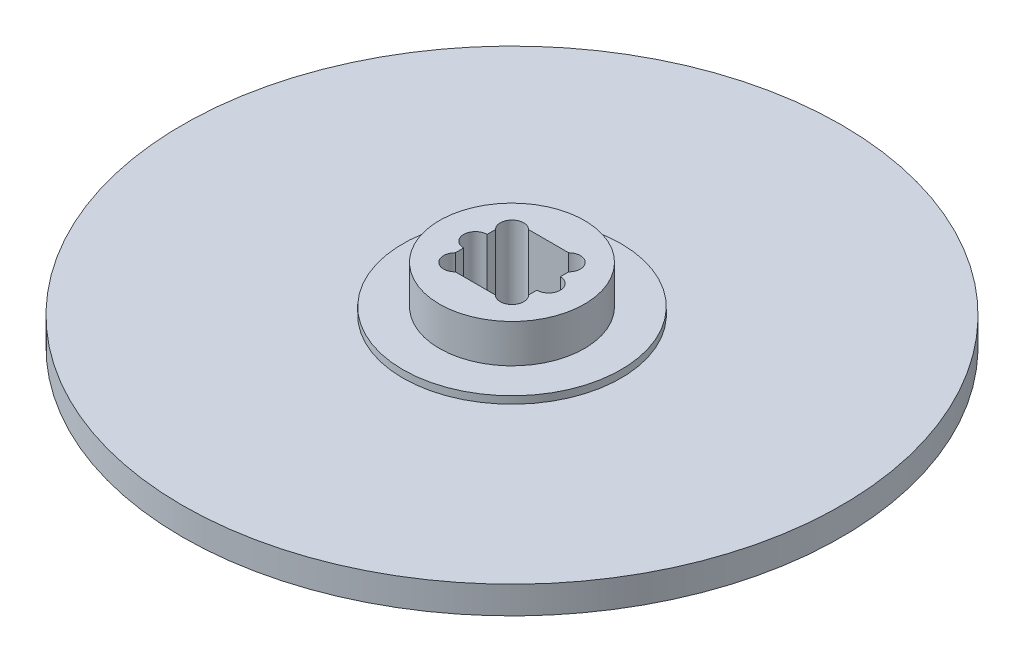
ISO-10303-21;
HEADER;
FILE_DESCRIPTION(('STEP AP214'),'2;1');
FILE_NAME('part.step','',(''),(''),'','','');
FILE_SCHEMA(('AUTOMOTIVE_DESIGN { 1 0 10303 214 1 1 1 1 }'));
ENDSEC;
DATA;
#1=APPLICATION_CONTEXT('core data for automotive mechanical design processes');
#2=APPLICATION_PROTOCOL_DEFINITION('international standard','automotive_design',2000,#1);
#3=PRODUCT_CONTEXT('',#1,'mechanical');
#4=PRODUCT('Part','Part','',(#3));
#5=PRODUCT_RELATED_PRODUCT_CATEGORY('part','',(#4));
#6=PRODUCT_DEFINITION_FORMATION('','',#4);
#7=PRODUCT_DEFINITION_CONTEXT('part definition',#1,'design');
#8=PRODUCT_DEFINITION('design','',#6,#7);
#9=PRODUCT_DEFINITION_SHAPE('','',#8);
#10=(LENGTH_UNIT() NAMED_UNIT(*) SI_UNIT(.MILLI.,.METRE.));
#11=(NAMED_UNIT(*) PLANE_ANGLE_UNIT() SI_UNIT($,.RADIAN.));
#12=(NAMED_UNIT(*) SI_UNIT($,.STERADIAN.) SOLID_ANGLE_UNIT());
#13=UNCERTAINTY_MEASURE_WITH_UNIT(LENGTH_MEASURE(1.E-05),#10,'distance_accuracy_value','');
#14=(GEOMETRIC_REPRESENTATION_CONTEXT(3) GLOBAL_UNCERTAINTY_ASSIGNED_CONTEXT((#13)) GLOBAL_UNIT_ASSIGNED_CONTEXT((#10,
#11,#12)) REPRESENTATION_CONTEXT('',''));
#15=CARTESIAN_POINT('',(0.,0.,0.));
#16=DIRECTION('',(0.,0.,1.));
#17=DIRECTION('',(1.,0.,0.));
#18=AXIS2_PLACEMENT_3D('',#15,#16,#17);
#19=CARTESIAN_POINT('',(0.,3.75,0.));
#20=DIRECTION('',(0.,1.,0.));
#21=DIRECTION('',(0.,0.,1.));
#22=AXIS2_PLACEMENT_3D('',#19,#20,#21);
#23=PLANE('',#22);
#24=CARTESIAN_POINT('',(0.,3.75,0.));
#25=DIRECTION('',(0.,1.,0.));
#26=DIRECTION('',(0.,0.,1.));
#27=AXIS2_PLACEMENT_3D('',#24,#25,#26);
#28=CIRCLE('',#27,45.);
#29=CARTESIAN_POINT('',(0.,3.75,45.));
#30=VERTEX_POINT('',#29);
#31=EDGE_CURVE('E197',#30,#30,#28,.T.);
#32=ORIENTED_EDGE('',*,*,#31,.T.);
#33=EDGE_LOOP('',(#32));
#34=FACE_BOUND('',#33,.T.);
#35=CARTESIAN_POINT('',(0.,3.75,0.));
#36=DIRECTION('',(0.,1.,0.));
#37=DIRECTION('',(0.,0.,1.));
#38=AXIS2_PLACEMENT_3D('',#35,#36,#37);
#39=CIRCLE('',#38,14.9);
#40=CARTESIAN_POINT('',(0.,3.75,14.9));
#41=VERTEX_POINT('',#40);
#42=EDGE_CURVE('E259',#41,#41,#39,.T.);
#43=ORIENTED_EDGE('',*,*,#42,.F.);
#44=EDGE_LOOP('',(#43));
#45=FACE_BOUND('',#44,.T.);
#46=ADVANCED_FACE('F32',(#34,#45),#23,.T.);
#47=CARTESIAN_POINT('',(5.,0.,-2.73725830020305));
#48=DIRECTION('',(1.,0.,0.));
#49=DIRECTION('',(0.,0.,-1.));
#50=AXIS2_PLACEMENT_3D('',#47,#48,#49);
#51=PLANE('',#50);
#52=DIRECTION('',(0.,0.,-1.));
#53=VECTOR('',#52,1.);
#54=CARTESIAN_POINT('',(5.,10.,-2.73725830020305));
#55=LINE('',#54,#53);
#56=CARTESIAN_POINT('',(4.99999999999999,10.,2.73725830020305));
#57=VERTEX_POINT('',#56);
#58=CARTESIAN_POINT('',(4.99999999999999,10.,1.6));
#59=VERTEX_POINT('',#58);
#60=EDGE_CURVE('E133',#57,#59,#55,.T.);
#61=ORIENTED_EDGE('',*,*,#60,.T.);
#62=DIRECTION('',(0.,-1.,0.));
#63=VECTOR('',#62,1.);
#64=CARTESIAN_POINT('',(4.99999999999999,10.,1.6));
#65=LINE('',#64,#63);
#66=CARTESIAN_POINT('',(4.99999999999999,0.,1.6));
#67=VERTEX_POINT('',#66);
#68=EDGE_CURVE('E11',#59,#67,#65,.T.);
#69=ORIENTED_EDGE('',*,*,#68,.T.);
#70=DIRECTION('',(0.,0.,-1.));
#71=VECTOR('',#70,1.);
#72=CARTESIAN_POINT('',(5.,0.,-2.73725830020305));
#73=LINE('',#72,#71);
#74=CARTESIAN_POINT('',(4.99999999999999,0.,2.73725830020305));
#75=VERTEX_POINT('',#74);
#76=EDGE_CURVE('E130',#75,#67,#73,.T.);
#77=ORIENTED_EDGE('',*,*,#76,.F.);
#78=DIRECTION('',(0.,1.,0.));
#79=VECTOR('',#78,1.);
#80=CARTESIAN_POINT('',(4.99999999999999,0.,2.73725830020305));
#81=LINE('',#80,#79);
#82=EDGE_CURVE('E183',#75,#57,#81,.T.);
#83=ORIENTED_EDGE('',*,*,#82,.T.);
#84=EDGE_LOOP('',(#61,#69,#77,#83));
#85=FACE_BOUND('',#84,.T.);
#86=ADVANCED_FACE('F129',(#85),#51,.F.);
#87=CARTESIAN_POINT('',(-5.,0.,-2.73725830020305));
#88=DIRECTION('',(-1.,0.,0.));
#89=DIRECTION('',(0.,0.,1.));
#90=AXIS2_PLACEMENT_3D('',#87,#88,#89);
#91=PLANE('',#90);
#92=DIRECTION('',(0.,0.,1.));
#93=VECTOR('',#92,1.);
#94=CARTESIAN_POINT('',(-5.,10.,-2.73725830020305));
#95=LINE('',#94,#93);
#96=CARTESIAN_POINT('',(-5.,10.,-2.73725830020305));
#97=VERTEX_POINT('',#96);
#98=CARTESIAN_POINT('',(-5.,10.,-1.6));
#99=VERTEX_POINT('',#98);
#100=EDGE_CURVE('E154',#97,#99,#95,.T.);
#101=ORIENTED_EDGE('',*,*,#100,.T.);
#102=DIRECTION('',(0.,-1.,0.));
#103=VECTOR('',#102,1.);
#104=CARTESIAN_POINT('',(-5.,10.,-1.6));
#105=LINE('',#104,#103);
#106=CARTESIAN_POINT('',(-5.,0.,-1.6));
#107=VERTEX_POINT('',#106);
#108=EDGE_CURVE('E204',#99,#107,#105,.T.);
#109=ORIENTED_EDGE('',*,*,#108,.T.);
#110=DIRECTION('',(0.,0.,1.));
#111=VECTOR('',#110,1.);
#112=CARTESIAN_POINT('',(-5.,0.,-2.73725830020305));
#113=LINE('',#112,#111);
#114=CARTESIAN_POINT('',(-5.,0.,-2.73725830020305));
#115=VERTEX_POINT('',#114);
#116=EDGE_CURVE('E230',#115,#107,#113,.T.);
#117=ORIENTED_EDGE('',*,*,#116,.F.);
#118=DIRECTION('',(0.,1.,0.));
#119=VECTOR('',#118,1.);
#120=CARTESIAN_POINT('',(-5.,0.,-2.73725830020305));
#121=LINE('',#120,#119);
#122=EDGE_CURVE('E150',#115,#97,#121,.T.);
#123=ORIENTED_EDGE('',*,*,#122,.T.);
#124=EDGE_LOOP('',(#101,#109,#117,#123));
#125=FACE_BOUND('',#124,.T.);
#126=ADVANCED_FACE('F289',(#125),#91,.F.);
#127=CARTESIAN_POINT('',(0.,3.75,0.));
#128=DIRECTION('',(0.,-1.,0.));
#129=DIRECTION('',(0.,0.,-1.));
#130=AXIS2_PLACEMENT_3D('',#127,#128,#129);
#131=CYLINDRICAL_SURFACE('',#130,45.);
#132=ORIENTED_EDGE('',*,*,#31,.F.);
#133=EDGE_LOOP('',(#132));
#134=FACE_BOUND('',#133,.T.);
#135=CARTESIAN_POINT('',(0.,0.,0.));
#136=DIRECTION('',(0.,1.,0.));
#137=DIRECTION('',(0.,0.,1.));
#138=AXIS2_PLACEMENT_3D('',#135,#136,#137);
#139=CIRCLE('',#138,45.);
#140=CARTESIAN_POINT('',(0.,0.,45.));
#141=VERTEX_POINT('',#140);
#142=EDGE_CURVE('E196',#141,#141,#139,.T.);
#143=ORIENTED_EDGE('',*,*,#142,.T.);
#144=EDGE_LOOP('',(#143));
#145=FACE_BOUND('',#144,.T.);
#146=ADVANCED_FACE('F34',(#134,#145),#131,.T.);
#147=CARTESIAN_POINT('',(0.,0.,0.));
#148=DIRECTION('',(0.,1.,0.));
#149=DIRECTION('',(0.,0.,1.));
#150=AXIS2_PLACEMENT_3D('',#147,#148,#149);
#151=PLANE('',#150);
#152=ORIENTED_EDGE('',*,*,#76,.T.);
#153=CARTESIAN_POINT('',(5.,0.,0.));
#154=DIRECTION('',(0.,-1.,0.));
#155=DIRECTION('',(0.,0.,1.));
#156=AXIS2_PLACEMENT_3D('',#153,#154,#155);
#157=CIRCLE('',#156,1.6);
#158=CARTESIAN_POINT('',(5.,0.,-1.6));
#159=VERTEX_POINT('',#158);
#160=EDGE_CURVE('E119',#159,#67,#157,.T.);
#161=ORIENTED_EDGE('',*,*,#160,.F.);
#162=CARTESIAN_POINT('',(5.,0.,-2.73725830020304));
#163=VERTEX_POINT('',#162);
#164=EDGE_CURVE('E140',#159,#163,#73,.T.);
#165=ORIENTED_EDGE('',*,*,#164,.T.);
#166=CARTESIAN_POINT('',(3.86862915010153,0.,-3.86862915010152));
#167=DIRECTION('',(0.,1.,0.));
#168=DIRECTION('',(0.,0.,-1.));
#169=AXIS2_PLACEMENT_3D('',#166,#167,#168);
#170=CIRCLE('',#169,1.6);
#171=CARTESIAN_POINT('',(2.73725830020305,0.,-5.));
#172=VERTEX_POINT('',#171);
#173=EDGE_CURVE('E139',#163,#172,#170,.T.);
#174=ORIENTED_EDGE('',*,*,#173,.T.);
#175=DIRECTION('',(-1.,0.,0.));
#176=VECTOR('',#175,1.);
#177=CARTESIAN_POINT('',(-2.73725830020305,0.,-5.));
#178=LINE('',#177,#176);
#179=CARTESIAN_POINT('',(-2.73725830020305,0.,-5.));
#180=VERTEX_POINT('',#179);
#181=EDGE_CURVE('E143',#172,#180,#178,.T.);
#182=ORIENTED_EDGE('',*,*,#181,.T.);
#183=CARTESIAN_POINT('',(-3.86862915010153,0.,-3.86862915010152));
#184=DIRECTION('',(0.,1.,0.));
#185=DIRECTION('',(0.,0.,1.));
#186=AXIS2_PLACEMENT_3D('',#183,#184,#185);
#187=CIRCLE('',#186,1.6);
#188=EDGE_CURVE('E174',#180,#115,#187,.T.);
#189=ORIENTED_EDGE('',*,*,#188,.T.);
#190=ORIENTED_EDGE('',*,*,#116,.T.);
#191=CARTESIAN_POINT('',(-5.,0.,0.));
#192=DIRECTION('',(0.,-1.,0.));
#193=DIRECTION('',(0.,0.,-1.));
#194=AXIS2_PLACEMENT_3D('',#191,#192,#193);
#195=CIRCLE('',#194,1.6);
#196=CARTESIAN_POINT('',(-5.,0.,1.6));
#197=VERTEX_POINT('',#196);
#198=EDGE_CURVE('E233',#197,#107,#195,.T.);
#199=ORIENTED_EDGE('',*,*,#198,.F.);
#200=CARTESIAN_POINT('',(-5.,0.,2.73725830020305));
#201=VERTEX_POINT('',#200);
#202=EDGE_CURVE('E228',#197,#201,#113,.T.);
#203=ORIENTED_EDGE('',*,*,#202,.T.);
#204=CARTESIAN_POINT('',(-3.86862915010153,0.,3.86862915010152));
#205=DIRECTION('',(0.,1.,0.));
#206=DIRECTION('',(0.,0.,-1.));
#207=AXIS2_PLACEMENT_3D('',#204,#205,#206);
#208=CIRCLE('',#207,1.6);
#209=CARTESIAN_POINT('',(-2.73725830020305,0.,5.));
#210=VERTEX_POINT('',#209);
#211=EDGE_CURVE('E236',#201,#210,#208,.T.);
#212=ORIENTED_EDGE('',*,*,#211,.T.);
#213=DIRECTION('',(1.,0.,0.));
#214=VECTOR('',#213,1.);
#215=CARTESIAN_POINT('',(-2.73725830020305,0.,5.));
#216=LINE('',#215,#214);
#217=CARTESIAN_POINT('',(2.73725830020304,0.,5.));
#218=VERTEX_POINT('',#217);
#219=EDGE_CURVE('E238',#210,#218,#216,.T.);
#220=ORIENTED_EDGE('',*,*,#219,.T.);
#221=CARTESIAN_POINT('',(3.86862915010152,0.,3.86862915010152));
#222=DIRECTION('',(0.,1.,0.));
#223=DIRECTION('',(0.,0.,1.));
#224=AXIS2_PLACEMENT_3D('',#221,#222,#223);
#225=CIRCLE('',#224,1.6);
#226=EDGE_CURVE('E138',#218,#75,#225,.T.);
#227=ORIENTED_EDGE('',*,*,#226,.T.);
#228=EDGE_LOOP('',(#152,#161,#165,#174,#182,#189,#190,#199,#203,#212,#220,#227));
#229=FACE_BOUND('',#228,.T.);
#230=ORIENTED_EDGE('',*,*,#142,.F.);
#231=EDGE_LOOP('',(#230));
#232=FACE_BOUND('',#231,.T.);
#233=ADVANCED_FACE('F134',(#229,#232),#151,.F.);
#234=CARTESIAN_POINT('',(0.,10.,0.));
#235=DIRECTION('',(0.,-1.,0.));
#236=DIRECTION('',(0.,0.,-1.));
#237=AXIS2_PLACEMENT_3D('',#234,#235,#236);
#238=CYLINDRICAL_SURFACE('',#237,9.9);
#239=CARTESIAN_POINT('',(0.,4.75,0.));
#240=DIRECTION('',(0.,1.,0.));
#241=DIRECTION('',(0.,0.,1.));
#242=AXIS2_PLACEMENT_3D('',#239,#240,#241);
#243=CIRCLE('',#242,9.9);
#244=CARTESIAN_POINT('',(0.,4.75,9.9));
#245=VERTEX_POINT('',#244);
#246=EDGE_CURVE('E262',#245,#245,#243,.T.);
#247=ORIENTED_EDGE('',*,*,#246,.T.);
#248=EDGE_LOOP('',(#247));
#249=FACE_BOUND('',#248,.T.);
#250=CARTESIAN_POINT('',(0.,10.,0.));
#251=DIRECTION('',(0.,1.,0.));
#252=DIRECTION('',(0.,0.,1.));
#253=AXIS2_PLACEMENT_3D('',#250,#251,#252);
#254=CIRCLE('',#253,9.9);
#255=CARTESIAN_POINT('',(0.,10.,9.9));
#256=VERTEX_POINT('',#255);
#257=EDGE_CURVE('E177',#256,#256,#254,.T.);
#258=ORIENTED_EDGE('',*,*,#257,.F.);
#259=EDGE_LOOP('',(#258));
#260=FACE_BOUND('',#259,.T.);
#261=ADVANCED_FACE('F268',(#249,#260),#238,.T.);
#262=CARTESIAN_POINT('',(0.,10.,0.));
#263=DIRECTION('',(0.,1.,0.));
#264=DIRECTION('',(0.,0.,1.));
#265=AXIS2_PLACEMENT_3D('',#262,#263,#264);
#266=PLANE('',#265);
#267=CARTESIAN_POINT('',(5.,10.,0.));
#268=DIRECTION('',(0.,-1.,0.));
#269=DIRECTION('',(0.,0.,1.));
#270=AXIS2_PLACEMENT_3D('',#267,#268,#269);
#271=CIRCLE('',#270,1.6);
#272=CARTESIAN_POINT('',(5.,10.,-1.6));
#273=VERTEX_POINT('',#272);
#274=EDGE_CURVE('E47',#273,#59,#271,.T.);
#275=ORIENTED_EDGE('',*,*,#274,.T.);
#276=ORIENTED_EDGE('',*,*,#60,.F.);
#277=CARTESIAN_POINT('',(3.86862915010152,10.,3.86862915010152));
#278=DIRECTION('',(0.,1.,0.));
#279=DIRECTION('',(0.,0.,1.));
#280=AXIS2_PLACEMENT_3D('',#277,#278,#279);
#281=CIRCLE('',#280,1.6);
#282=CARTESIAN_POINT('',(2.73725830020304,10.,5.));
#283=VERTEX_POINT('',#282);
#284=EDGE_CURVE('E163',#283,#57,#281,.T.);
#285=ORIENTED_EDGE('',*,*,#284,.F.);
#286=DIRECTION('',(1.,0.,0.));
#287=VECTOR('',#286,1.);
#288=CARTESIAN_POINT('',(-2.73725830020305,10.,5.));
#289=LINE('',#288,#287);
#290=CARTESIAN_POINT('',(-2.73725830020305,10.,5.));
#291=VERTEX_POINT('',#290);
#292=EDGE_CURVE('E160',#291,#283,#289,.T.);
#293=ORIENTED_EDGE('',*,*,#292,.F.);
#294=CARTESIAN_POINT('',(-3.86862915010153,10.,3.86862915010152));
#295=DIRECTION('',(0.,1.,0.));
#296=DIRECTION('',(0.,0.,-1.));
#297=AXIS2_PLACEMENT_3D('',#294,#295,#296);
#298=CIRCLE('',#297,1.6);
#299=CARTESIAN_POINT('',(-5.,10.,2.73725830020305));
#300=VERTEX_POINT('',#299);
#301=EDGE_CURVE('E157',#300,#291,#298,.T.);
#302=ORIENTED_EDGE('',*,*,#301,.F.);
#303=CARTESIAN_POINT('',(-5.,10.,1.6));
#304=VERTEX_POINT('',#303);
#305=EDGE_CURVE('E153',#304,#300,#95,.T.);
#306=ORIENTED_EDGE('',*,*,#305,.F.);
#307=CARTESIAN_POINT('',(-5.,10.,0.));
#308=DIRECTION('',(0.,-1.,0.));
#309=DIRECTION('',(0.,0.,-1.));
#310=AXIS2_PLACEMENT_3D('',#307,#308,#309);
#311=CIRCLE('',#310,1.6);
#312=EDGE_CURVE('E55',#304,#99,#311,.T.);
#313=ORIENTED_EDGE('',*,*,#312,.T.);
#314=ORIENTED_EDGE('',*,*,#100,.F.);
#315=CARTESIAN_POINT('',(-3.86862915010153,10.,-3.86862915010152));
#316=DIRECTION('',(0.,1.,0.));
#317=DIRECTION('',(0.,0.,1.));
#318=AXIS2_PLACEMENT_3D('',#315,#316,#317);
#319=CIRCLE('',#318,1.6);
#320=CARTESIAN_POINT('',(-2.73725830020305,10.,-5.));
#321=VERTEX_POINT('',#320);
#322=EDGE_CURVE('E151',#321,#97,#319,.T.);
#323=ORIENTED_EDGE('',*,*,#322,.F.);
#324=DIRECTION('',(-1.,0.,0.));
#325=VECTOR('',#324,1.);
#326=CARTESIAN_POINT('',(-2.73725830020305,10.,-5.));
#327=LINE('',#326,#325);
#328=CARTESIAN_POINT('',(2.73725830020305,10.,-5.));
#329=VERTEX_POINT('',#328);
#330=EDGE_CURVE('E171',#329,#321,#327,.T.);
#331=ORIENTED_EDGE('',*,*,#330,.F.);
#332=CARTESIAN_POINT('',(3.86862915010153,10.,-3.86862915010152));
#333=DIRECTION('',(0.,1.,0.));
#334=DIRECTION('',(0.,0.,-1.));
#335=AXIS2_PLACEMENT_3D('',#332,#333,#334);
#336=CIRCLE('',#335,1.6);
#337=CARTESIAN_POINT('',(5.,10.,-2.73725830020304));
#338=VERTEX_POINT('',#337);
#339=EDGE_CURVE('E168',#338,#329,#336,.T.);
#340=ORIENTED_EDGE('',*,*,#339,.F.);
#341=EDGE_CURVE('E166',#273,#338,#55,.T.);
#342=ORIENTED_EDGE('',*,*,#341,.F.);
#343=EDGE_LOOP('',(#275,#276,#285,#293,#302,#306,#313,#314,#323,#331,#340,#342));
#344=FACE_BOUND('',#343,.T.);
#345=ORIENTED_EDGE('',*,*,#257,.T.);
#346=EDGE_LOOP('',(#345));
#347=FACE_BOUND('',#346,.T.);
#348=ADVANCED_FACE('F212',(#344,#347),#266,.T.);
#349=CARTESIAN_POINT('',(-3.86862915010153,0.,-3.86862915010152));
#350=DIRECTION('',(0.,1.,0.));
#351=DIRECTION('',(0.,0.,1.));
#352=AXIS2_PLACEMENT_3D('',#349,#350,#351);
#353=CYLINDRICAL_SURFACE('',#352,1.6);
#354=ORIENTED_EDGE('',*,*,#322,.T.);
#355=ORIENTED_EDGE('',*,*,#122,.F.);
#356=ORIENTED_EDGE('',*,*,#188,.F.);
#357=DIRECTION('',(0.,1.,0.));
#358=VECTOR('',#357,1.);
#359=CARTESIAN_POINT('',(-2.73725830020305,0.,-5.));
#360=LINE('',#359,#358);
#361=EDGE_CURVE('E175',#180,#321,#360,.T.);
#362=ORIENTED_EDGE('',*,*,#361,.T.);
#363=EDGE_LOOP('',(#354,#355,#356,#362));
#364=FACE_BOUND('',#363,.T.);
#365=ADVANCED_FACE('F226',(#364),#353,.F.);
#366=CARTESIAN_POINT('',(-2.73725830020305,0.,-5.));
#367=DIRECTION('',(0.,0.,-1.));
#368=DIRECTION('',(-1.,0.,0.));
#369=AXIS2_PLACEMENT_3D('',#366,#367,#368);
#370=PLANE('',#369);
#371=ORIENTED_EDGE('',*,*,#330,.T.);
#372=ORIENTED_EDGE('',*,*,#361,.F.);
#373=ORIENTED_EDGE('',*,*,#181,.F.);
#374=DIRECTION('',(0.,1.,0.));
#375=VECTOR('',#374,1.);
#376=CARTESIAN_POINT('',(2.73725830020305,0.,-5.));
#377=LINE('',#376,#375);
#378=EDGE_CURVE('E178',#172,#329,#377,.T.);
#379=ORIENTED_EDGE('',*,*,#378,.T.);
#380=EDGE_LOOP('',(#371,#372,#373,#379));
#381=FACE_BOUND('',#380,.T.);
#382=ADVANCED_FACE('F224',(#381),#370,.F.);
#383=CARTESIAN_POINT('',(3.86862915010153,0.,-3.86862915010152));
#384=DIRECTION('',(0.,1.,0.));
#385=DIRECTION('',(0.,0.,1.));
#386=AXIS2_PLACEMENT_3D('',#383,#384,#385);
#387=CYLINDRICAL_SURFACE('',#386,1.6);
#388=ORIENTED_EDGE('',*,*,#339,.T.);
#389=ORIENTED_EDGE('',*,*,#378,.F.);
#390=ORIENTED_EDGE('',*,*,#173,.F.);
#391=DIRECTION('',(0.,1.,0.));
#392=VECTOR('',#391,1.);
#393=CARTESIAN_POINT('',(5.,0.,-2.73725830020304));
#394=LINE('',#393,#392);
#395=EDGE_CURVE('E180',#163,#338,#394,.T.);
#396=ORIENTED_EDGE('',*,*,#395,.T.);
#397=EDGE_LOOP('',(#388,#389,#390,#396));
#398=FACE_BOUND('',#397,.T.);
#399=ADVANCED_FACE('F217',(#398),#387,.F.);
#400=ORIENTED_EDGE('',*,*,#164,.F.);
#401=DIRECTION('',(0.,-1.,0.));
#402=VECTOR('',#401,1.);
#403=CARTESIAN_POINT('',(5.,10.,-1.6));
#404=LINE('',#403,#402);
#405=EDGE_CURVE('E40',#159,#273,#404,.F.);
#406=ORIENTED_EDGE('',*,*,#405,.T.);
#407=ORIENTED_EDGE('',*,*,#341,.T.);
#408=ORIENTED_EDGE('',*,*,#395,.F.);
#409=EDGE_LOOP('',(#400,#406,#407,#408));
#410=FACE_BOUND('',#409,.T.);
#411=ADVANCED_FACE('F208',(#410),#51,.F.);
#412=CARTESIAN_POINT('',(3.86862915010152,0.,3.86862915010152));
#413=DIRECTION('',(0.,1.,0.));
#414=DIRECTION('',(0.,0.,1.));
#415=AXIS2_PLACEMENT_3D('',#412,#413,#414);
#416=CYLINDRICAL_SURFACE('',#415,1.6);
#417=ORIENTED_EDGE('',*,*,#284,.T.);
#418=ORIENTED_EDGE('',*,*,#82,.F.);
#419=ORIENTED_EDGE('',*,*,#226,.F.);
#420=DIRECTION('',(0.,1.,0.));
#421=VECTOR('',#420,1.);
#422=CARTESIAN_POINT('',(2.73725830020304,0.,5.));
#423=LINE('',#422,#421);
#424=EDGE_CURVE('E185',#218,#283,#423,.T.);
#425=ORIENTED_EDGE('',*,*,#424,.T.);
#426=EDGE_LOOP('',(#417,#418,#419,#425));
#427=FACE_BOUND('',#426,.T.);
#428=ADVANCED_FACE('F246',(#427),#416,.F.);
#429=CARTESIAN_POINT('',(-2.73725830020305,0.,5.));
#430=DIRECTION('',(0.,0.,1.));
#431=DIRECTION('',(1.,0.,0.));
#432=AXIS2_PLACEMENT_3D('',#429,#430,#431);
#433=PLANE('',#432);
#434=ORIENTED_EDGE('',*,*,#292,.T.);
#435=ORIENTED_EDGE('',*,*,#424,.F.);
#436=ORIENTED_EDGE('',*,*,#219,.F.);
#437=DIRECTION('',(0.,1.,0.));
#438=VECTOR('',#437,1.);
#439=CARTESIAN_POINT('',(-2.73725830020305,0.,5.));
#440=LINE('',#439,#438);
#441=EDGE_CURVE('E187',#210,#291,#440,.T.);
#442=ORIENTED_EDGE('',*,*,#441,.T.);
#443=EDGE_LOOP('',(#434,#435,#436,#442));
#444=FACE_BOUND('',#443,.T.);
#445=ADVANCED_FACE('F242',(#444),#433,.F.);
#446=CARTESIAN_POINT('',(-3.86862915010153,0.,3.86862915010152));
#447=DIRECTION('',(0.,1.,0.));
#448=DIRECTION('',(0.,0.,1.));
#449=AXIS2_PLACEMENT_3D('',#446,#447,#448);
#450=CYLINDRICAL_SURFACE('',#449,1.6);
#451=ORIENTED_EDGE('',*,*,#301,.T.);
#452=ORIENTED_EDGE('',*,*,#441,.F.);
#453=ORIENTED_EDGE('',*,*,#211,.F.);
#454=DIRECTION('',(0.,1.,0.));
#455=VECTOR('',#454,1.);
#456=CARTESIAN_POINT('',(-5.,0.,2.73725830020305));
#457=LINE('',#456,#455);
#458=EDGE_CURVE('E189',#201,#300,#457,.T.);
#459=ORIENTED_EDGE('',*,*,#458,.T.);
#460=EDGE_LOOP('',(#451,#452,#453,#459));
#461=FACE_BOUND('',#460,.T.);
#462=ADVANCED_FACE('F250',(#461),#450,.F.);
#463=ORIENTED_EDGE('',*,*,#202,.F.);
#464=DIRECTION('',(0.,-1.,0.));
#465=VECTOR('',#464,1.);
#466=CARTESIAN_POINT('',(-5.,10.,1.6));
#467=LINE('',#466,#465);
#468=EDGE_CURVE('E200',#197,#304,#467,.F.);
#469=ORIENTED_EDGE('',*,*,#468,.T.);
#470=ORIENTED_EDGE('',*,*,#305,.T.);
#471=ORIENTED_EDGE('',*,*,#458,.F.);
#472=EDGE_LOOP('',(#463,#469,#470,#471));
#473=FACE_BOUND('',#472,.T.);
#474=ADVANCED_FACE('F254',(#473),#91,.F.);
#475=CARTESIAN_POINT('',(-5.,10.,0.));
#476=DIRECTION('',(0.,-1.,0.));
#477=DIRECTION('',(0.,0.,-1.));
#478=AXIS2_PLACEMENT_3D('',#475,#476,#477);
#479=CYLINDRICAL_SURFACE('',#478,1.6);
#480=ORIENTED_EDGE('',*,*,#312,.F.);
#481=ORIENTED_EDGE('',*,*,#468,.F.);
#482=ORIENTED_EDGE('',*,*,#198,.T.);
#483=ORIENTED_EDGE('',*,*,#108,.F.);
#484=EDGE_LOOP('',(#480,#481,#482,#483));
#485=FACE_BOUND('',#484,.T.);
#486=ADVANCED_FACE('F256',(#485),#479,.F.);
#487=CARTESIAN_POINT('',(5.,10.,0.));
#488=DIRECTION('',(0.,-1.,0.));
#489=DIRECTION('',(0.,0.,-1.));
#490=AXIS2_PLACEMENT_3D('',#487,#488,#489);
#491=CYLINDRICAL_SURFACE('',#490,1.6);
#492=ORIENTED_EDGE('',*,*,#274,.F.);
#493=ORIENTED_EDGE('',*,*,#405,.F.);
#494=ORIENTED_EDGE('',*,*,#160,.T.);
#495=ORIENTED_EDGE('',*,*,#68,.F.);
#496=EDGE_LOOP('',(#492,#493,#494,#495));
#497=FACE_BOUND('',#496,.T.);
#498=ADVANCED_FACE('F120',(#497),#491,.F.);
#499=CARTESIAN_POINT('',(0.,4.75,0.));
#500=DIRECTION('',(0.,1.,0.));
#501=DIRECTION('',(0.,0.,1.));
#502=AXIS2_PLACEMENT_3D('',#499,#500,#501);
#503=PLANE('',#502);
#504=CARTESIAN_POINT('',(0.,4.75,0.));
#505=DIRECTION('',(0.,1.,0.));
#506=DIRECTION('',(0.,0.,1.));
#507=AXIS2_PLACEMENT_3D('',#504,#505,#506);
#508=CIRCLE('',#507,14.9);
#509=CARTESIAN_POINT('',(0.,4.75,14.9));
#510=VERTEX_POINT('',#509);
#511=EDGE_CURVE('E124',#510,#510,#508,.T.);
#512=ORIENTED_EDGE('',*,*,#511,.T.);
#513=EDGE_LOOP('',(#512));
#514=FACE_BOUND('',#513,.T.);
#515=ORIENTED_EDGE('',*,*,#246,.F.);
#516=EDGE_LOOP('',(#515));
#517=FACE_BOUND('',#516,.T.);
#518=ADVANCED_FACE('F271',(#514,#517),#503,.T.);
#519=CARTESIAN_POINT('',(0.,4.75,0.));
#520=DIRECTION('',(0.,-1.,0.));
#521=DIRECTION('',(0.,0.,-1.));
#522=AXIS2_PLACEMENT_3D('',#519,#520,#521);
#523=CYLINDRICAL_SURFACE('',#522,14.9);
#524=ORIENTED_EDGE('',*,*,#511,.F.);
#525=EDGE_LOOP('',(#524));
#526=FACE_BOUND('',#525,.T.);
#527=ORIENTED_EDGE('',*,*,#42,.T.);
#528=EDGE_LOOP('',(#527));
#529=FACE_BOUND('',#528,.T.);
#530=ADVANCED_FACE('F273',(#526,#529),#523,.T.);
#531=CLOSED_SHELL('',(#46,#86,#126,#146,#233,#261,#348,#365,#382,#399,#411,#428,#445,#462,#474,
#486,#498,#518,#530));
#532=MANIFOLD_SOLID_BREP('B2',#531);
#533=ADVANCED_BREP_SHAPE_REPRESENTATION('',(#18,#532),#14);
#534=SHAPE_DEFINITION_REPRESENTATION(#9,#533);
ENDSEC;
END-ISO-10303-21;
